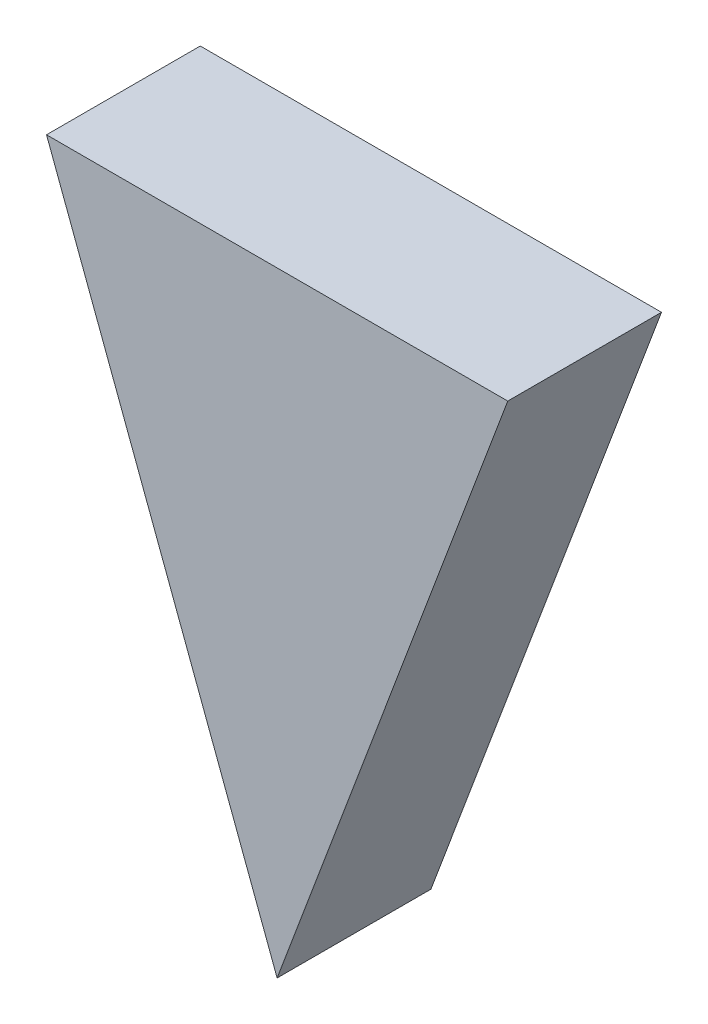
from build123d import *

# Parameters (mm, degrees)
AUFSATZ_LINEAR_AUSTRAGEN1_DEPTH = 10


with BuildPart() as part:
    # Skizze1 → Aufsatz-Linear austragen1 (new body)
    with BuildSketch(Plane.XY):
        Polygon((0, 0), (-15, 40), (15, 40), align=None)
    extrude(amount=AUFSATZ_LINEAR_AUSTRAGEN1_DEPTH)


solid = part.part
